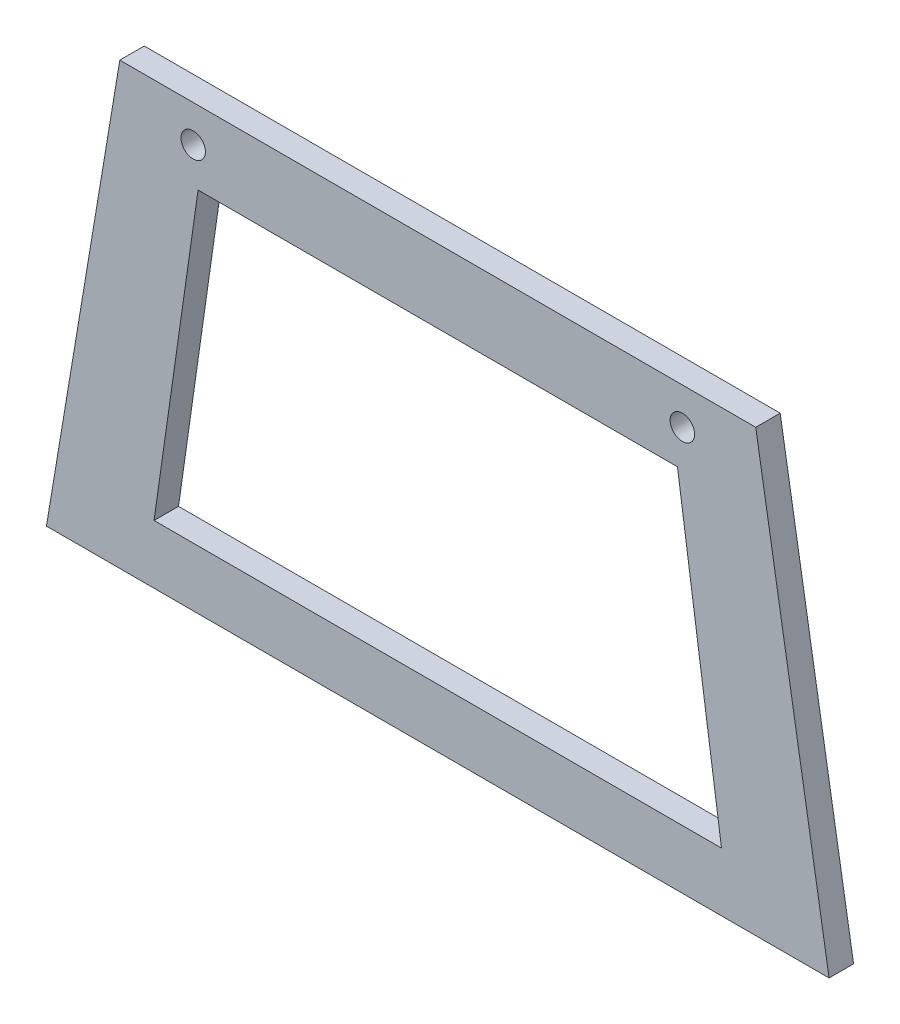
ISO-10303-21;
HEADER;
FILE_DESCRIPTION(('STEP AP214'),'2;1');
FILE_NAME('part.step','',(''),(''),'','','');
FILE_SCHEMA(('AUTOMOTIVE_DESIGN { 1 0 10303 214 1 1 1 1 }'));
ENDSEC;
DATA;
#1=APPLICATION_CONTEXT('core data for automotive mechanical design processes');
#2=APPLICATION_PROTOCOL_DEFINITION('international standard','automotive_design',2000,#1);
#3=PRODUCT_CONTEXT('',#1,'mechanical');
#4=PRODUCT('Part','Part','',(#3));
#5=PRODUCT_RELATED_PRODUCT_CATEGORY('part','',(#4));
#6=PRODUCT_DEFINITION_FORMATION('','',#4);
#7=PRODUCT_DEFINITION_CONTEXT('part definition',#1,'design');
#8=PRODUCT_DEFINITION('design','',#6,#7);
#9=PRODUCT_DEFINITION_SHAPE('','',#8);
#10=(LENGTH_UNIT() NAMED_UNIT(*) SI_UNIT(.MILLI.,.METRE.));
#11=(NAMED_UNIT(*) PLANE_ANGLE_UNIT() SI_UNIT($,.RADIAN.));
#12=(NAMED_UNIT(*) SI_UNIT($,.STERADIAN.) SOLID_ANGLE_UNIT());
#13=UNCERTAINTY_MEASURE_WITH_UNIT(LENGTH_MEASURE(1.E-05),#10,'distance_accuracy_value','');
#14=(GEOMETRIC_REPRESENTATION_CONTEXT(3) GLOBAL_UNCERTAINTY_ASSIGNED_CONTEXT((#13)) GLOBAL_UNIT_ASSIGNED_CONTEXT((#10,
#11,#12)) REPRESENTATION_CONTEXT('',''));
#15=CARTESIAN_POINT('',(0.,0.,0.));
#16=DIRECTION('',(0.,0.,1.));
#17=DIRECTION('',(1.,0.,0.));
#18=AXIS2_PLACEMENT_3D('',#15,#16,#17);
#19=CARTESIAN_POINT('',(-82.55,114.3,3.175));
#20=DIRECTION('',(0.986393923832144,-0.164398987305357,0.));
#21=DIRECTION('',(0.164398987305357,0.986393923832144,0.));
#22=AXIS2_PLACEMENT_3D('',#19,#20,#21);
#23=PLANE('',#22);
#24=DIRECTION('',(-0.164398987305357,-0.986393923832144,0.));
#25=VECTOR('',#24,1.);
#26=CARTESIAN_POINT('',(-82.55,114.3,-3.175));
#27=LINE('',#26,#25);
#28=CARTESIAN_POINT('',(-82.55,114.3,-3.175));
#29=VERTEX_POINT('',#28);
#30=CARTESIAN_POINT('',(-101.6,0.,-3.175));
#31=VERTEX_POINT('',#30);
#32=EDGE_CURVE('E153',#29,#31,#27,.T.);
#33=ORIENTED_EDGE('',*,*,#32,.T.);
#34=DIRECTION('',(0.,0.,-1.));
#35=VECTOR('',#34,1.);
#36=CARTESIAN_POINT('',(-101.6,0.,3.175));
#37=LINE('',#36,#35);
#38=CARTESIAN_POINT('',(-101.6,0.,3.175));
#39=VERTEX_POINT('',#38);
#40=EDGE_CURVE('E110',#39,#31,#37,.T.);
#41=ORIENTED_EDGE('',*,*,#40,.F.);
#42=DIRECTION('',(-0.164398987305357,-0.986393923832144,0.));
#43=VECTOR('',#42,1.);
#44=CARTESIAN_POINT('',(-82.55,114.3,3.175));
#45=LINE('',#44,#43);
#46=CARTESIAN_POINT('',(-82.55,114.3,3.175));
#47=VERTEX_POINT('',#46);
#48=EDGE_CURVE('E146',#47,#39,#45,.T.);
#49=ORIENTED_EDGE('',*,*,#48,.F.);
#50=DIRECTION('',(0.,0.,-1.));
#51=VECTOR('',#50,1.);
#52=CARTESIAN_POINT('',(-82.55,114.3,3.175));
#53=LINE('',#52,#51);
#54=EDGE_CURVE('E142',#47,#29,#53,.T.);
#55=ORIENTED_EDGE('',*,*,#54,.T.);
#56=EDGE_LOOP('',(#33,#41,#49,#55));
#57=FACE_BOUND('',#56,.T.);
#58=ADVANCED_FACE('F41',(#57),#23,.F.);
#59=CARTESIAN_POINT('',(-101.6,0.,3.175));
#60=DIRECTION('',(0.,1.,0.));
#61=DIRECTION('',(0.,0.,1.));
#62=AXIS2_PLACEMENT_3D('',#59,#60,#61);
#63=PLANE('',#62);
#64=DIRECTION('',(1.,0.,0.));
#65=VECTOR('',#64,1.);
#66=CARTESIAN_POINT('',(-101.6,0.,-3.175));
#67=LINE('',#66,#65);
#68=CARTESIAN_POINT('',(101.6,0.,-3.175));
#69=VERTEX_POINT('',#68);
#70=EDGE_CURVE('E151',#31,#69,#67,.T.);
#71=ORIENTED_EDGE('',*,*,#70,.T.);
#72=DIRECTION('',(0.,0.,-1.));
#73=VECTOR('',#72,1.);
#74=CARTESIAN_POINT('',(101.6,0.,3.175));
#75=LINE('',#74,#73);
#76=CARTESIAN_POINT('',(101.6,0.,3.175));
#77=VERTEX_POINT('',#76);
#78=EDGE_CURVE('E136',#77,#69,#75,.T.);
#79=ORIENTED_EDGE('',*,*,#78,.F.);
#80=DIRECTION('',(1.,0.,0.));
#81=VECTOR('',#80,1.);
#82=CARTESIAN_POINT('',(-101.6,0.,3.175));
#83=LINE('',#82,#81);
#84=EDGE_CURVE('E157',#39,#77,#83,.T.);
#85=ORIENTED_EDGE('',*,*,#84,.F.);
#86=ORIENTED_EDGE('',*,*,#40,.T.);
#87=EDGE_LOOP('',(#71,#79,#85,#86));
#88=FACE_BOUND('',#87,.T.);
#89=ADVANCED_FACE('F195',(#88),#63,.F.);
#90=CARTESIAN_POINT('',(101.6,0.,3.175));
#91=DIRECTION('',(-0.986393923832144,-0.164398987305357,0.));
#92=DIRECTION('',(0.164398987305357,-0.986393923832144,0.));
#93=AXIS2_PLACEMENT_3D('',#90,#91,#92);
#94=PLANE('',#93);
#95=DIRECTION('',(-0.164398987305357,0.986393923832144,0.));
#96=VECTOR('',#95,1.);
#97=CARTESIAN_POINT('',(101.6,0.,-3.175));
#98=LINE('',#97,#96);
#99=CARTESIAN_POINT('',(82.55,114.3,-3.175));
#100=VERTEX_POINT('',#99);
#101=EDGE_CURVE('E149',#69,#100,#98,.T.);
#102=ORIENTED_EDGE('',*,*,#101,.T.);
#103=DIRECTION('',(0.,0.,-1.));
#104=VECTOR('',#103,1.);
#105=CARTESIAN_POINT('',(82.55,114.3,3.175));
#106=LINE('',#105,#104);
#107=CARTESIAN_POINT('',(82.55,114.3,3.175));
#108=VERTEX_POINT('',#107);
#109=EDGE_CURVE('E138',#108,#100,#106,.T.);
#110=ORIENTED_EDGE('',*,*,#109,.F.);
#111=DIRECTION('',(-0.164398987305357,0.986393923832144,0.));
#112=VECTOR('',#111,1.);
#113=CARTESIAN_POINT('',(101.6,0.,3.175));
#114=LINE('',#113,#112);
#115=EDGE_CURVE('E160',#77,#108,#114,.T.);
#116=ORIENTED_EDGE('',*,*,#115,.F.);
#117=ORIENTED_EDGE('',*,*,#78,.T.);
#118=EDGE_LOOP('',(#102,#110,#116,#117));
#119=FACE_BOUND('',#118,.T.);
#120=ADVANCED_FACE('F199',(#119),#94,.F.);
#121=CARTESIAN_POINT('',(82.55,114.3,3.175));
#122=DIRECTION('',(0.,-1.,0.));
#123=DIRECTION('',(0.,0.,-1.));
#124=AXIS2_PLACEMENT_3D('',#121,#122,#123);
#125=PLANE('',#124);
#126=DIRECTION('',(-1.,0.,0.));
#127=VECTOR('',#126,1.);
#128=CARTESIAN_POINT('',(82.55,114.3,-3.175));
#129=LINE('',#128,#127);
#130=EDGE_CURVE('E148',#100,#29,#129,.T.);
#131=ORIENTED_EDGE('',*,*,#130,.T.);
#132=ORIENTED_EDGE('',*,*,#54,.F.);
#133=DIRECTION('',(-1.,0.,0.));
#134=VECTOR('',#133,1.);
#135=CARTESIAN_POINT('',(82.55,114.3,3.175));
#136=LINE('',#135,#134);
#137=EDGE_CURVE('E144',#108,#47,#136,.T.);
#138=ORIENTED_EDGE('',*,*,#137,.F.);
#139=ORIENTED_EDGE('',*,*,#109,.T.);
#140=EDGE_LOOP('',(#131,#132,#138,#139));
#141=FACE_BOUND('',#140,.T.);
#142=ADVANCED_FACE('F214',(#141),#125,.F.);
#143=CARTESIAN_POINT('',(0.,0.,3.175));
#144=DIRECTION('',(0.,0.,1.));
#145=DIRECTION('',(1.,0.,0.));
#146=AXIS2_PLACEMENT_3D('',#143,#144,#145);
#147=PLANE('',#146);
#148=DIRECTION('',(-0.141421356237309,-0.989949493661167,0.));
#149=VECTOR('',#148,1.);
#150=CARTESIAN_POINT('',(-74.3204,10.6172,3.175));
#151=LINE('',#150,#149);
#152=CARTESIAN_POINT('',(-62.23,95.25,3.175));
#153=VERTEX_POINT('',#152);
#154=CARTESIAN_POINT('',(-73.66,15.24,3.175));
#155=VERTEX_POINT('',#154);
#156=EDGE_CURVE('E111',#153,#155,#151,.T.);
#157=ORIENTED_EDGE('',*,*,#156,.F.);
#158=DIRECTION('',(-1.,0.,0.));
#159=VECTOR('',#158,1.);
#160=CARTESIAN_POINT('',(0.,95.25,3.175));
#161=LINE('',#160,#159);
#162=CARTESIAN_POINT('',(62.23,95.25,3.175));
#163=VERTEX_POINT('',#162);
#164=EDGE_CURVE('E163',#163,#153,#161,.T.);
#165=ORIENTED_EDGE('',*,*,#164,.F.);
#166=DIRECTION('',(-0.141421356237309,0.989949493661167,0.));
#167=VECTOR('',#166,1.);
#168=CARTESIAN_POINT('',(74.3204,10.6172,3.175));
#169=LINE('',#168,#167);
#170=CARTESIAN_POINT('',(73.66,15.24,3.175));
#171=VERTEX_POINT('',#170);
#172=EDGE_CURVE('E167',#171,#163,#169,.T.);
#173=ORIENTED_EDGE('',*,*,#172,.F.);
#174=DIRECTION('',(1.,0.,0.));
#175=VECTOR('',#174,1.);
#176=CARTESIAN_POINT('',(0.,15.24,3.175));
#177=LINE('',#176,#175);
#178=EDGE_CURVE('E169',#155,#171,#177,.T.);
#179=ORIENTED_EDGE('',*,*,#178,.F.);
#180=EDGE_LOOP('',(#157,#165,#173,#179));
#181=FACE_BOUND('',#180,.T.);
#182=CARTESIAN_POINT('',(-63.5,104.775,3.175));
#183=DIRECTION('',(0.,0.,1.));
#184=DIRECTION('',(1.,0.,0.));
#185=AXIS2_PLACEMENT_3D('',#182,#183,#184);
#186=CIRCLE('',#185,3.175);
#187=CARTESIAN_POINT('',(-60.325,104.775,3.175));
#188=VERTEX_POINT('',#187);
#189=EDGE_CURVE('E126',#188,#188,#186,.T.);
#190=ORIENTED_EDGE('',*,*,#189,.F.);
#191=EDGE_LOOP('',(#190));
#192=FACE_BOUND('',#191,.T.);
#193=CARTESIAN_POINT('',(63.5,104.775,3.175));
#194=DIRECTION('',(0.,0.,1.));
#195=DIRECTION('',(1.,0.,0.));
#196=AXIS2_PLACEMENT_3D('',#193,#194,#195);
#197=CIRCLE('',#196,3.175);
#198=CARTESIAN_POINT('',(66.675,104.775,3.175));
#199=VERTEX_POINT('',#198);
#200=EDGE_CURVE('E129',#199,#199,#197,.T.);
#201=ORIENTED_EDGE('',*,*,#200,.F.);
#202=EDGE_LOOP('',(#201));
#203=FACE_BOUND('',#202,.T.);
#204=ORIENTED_EDGE('',*,*,#48,.T.);
#205=ORIENTED_EDGE('',*,*,#84,.T.);
#206=ORIENTED_EDGE('',*,*,#115,.T.);
#207=ORIENTED_EDGE('',*,*,#137,.T.);
#208=EDGE_LOOP('',(#204,#205,#206,#207));
#209=FACE_BOUND('',#208,.T.);
#210=ADVANCED_FACE('F178',(#181,#192,#203,#209),#147,.T.);
#211=CARTESIAN_POINT('',(0.,0.,-3.175));
#212=DIRECTION('',(0.,0.,1.));
#213=DIRECTION('',(1.,0.,0.));
#214=AXIS2_PLACEMENT_3D('',#211,#212,#213);
#215=PLANE('',#214);
#216=DIRECTION('',(-1.,0.,0.));
#217=VECTOR('',#216,1.);
#218=CARTESIAN_POINT('',(0.,95.25,-3.175));
#219=LINE('',#218,#217);
#220=CARTESIAN_POINT('',(62.23,95.25,-3.175));
#221=VERTEX_POINT('',#220);
#222=CARTESIAN_POINT('',(-62.23,95.25,-3.175));
#223=VERTEX_POINT('',#222);
#224=EDGE_CURVE('E48',#221,#223,#219,.T.);
#225=ORIENTED_EDGE('',*,*,#224,.T.);
#226=DIRECTION('',(-0.141421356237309,-0.989949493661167,0.));
#227=VECTOR('',#226,1.);
#228=CARTESIAN_POINT('',(-74.3204,10.6172,-3.175));
#229=LINE('',#228,#227);
#230=CARTESIAN_POINT('',(-73.66,15.24,-3.175));
#231=VERTEX_POINT('',#230);
#232=EDGE_CURVE('E11',#223,#231,#229,.T.);
#233=ORIENTED_EDGE('',*,*,#232,.T.);
#234=DIRECTION('',(1.,0.,0.));
#235=VECTOR('',#234,1.);
#236=CARTESIAN_POINT('',(0.,15.24,-3.175));
#237=LINE('',#236,#235);
#238=CARTESIAN_POINT('',(73.66,15.24,-3.175));
#239=VERTEX_POINT('',#238);
#240=EDGE_CURVE('E105',#231,#239,#237,.T.);
#241=ORIENTED_EDGE('',*,*,#240,.T.);
#242=DIRECTION('',(-0.141421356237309,0.989949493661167,0.));
#243=VECTOR('',#242,1.);
#244=CARTESIAN_POINT('',(74.3204,10.6172,-3.175));
#245=LINE('',#244,#243);
#246=EDGE_CURVE('E106',#239,#221,#245,.T.);
#247=ORIENTED_EDGE('',*,*,#246,.T.);
#248=EDGE_LOOP('',(#225,#233,#241,#247));
#249=FACE_BOUND('',#248,.T.);
#250=CARTESIAN_POINT('',(-63.5,104.775,-3.175));
#251=DIRECTION('',(0.,0.,1.));
#252=DIRECTION('',(1.,0.,0.));
#253=AXIS2_PLACEMENT_3D('',#250,#251,#252);
#254=CIRCLE('',#253,3.175);
#255=CARTESIAN_POINT('',(-60.325,104.775,-3.175));
#256=VERTEX_POINT('',#255);
#257=EDGE_CURVE('E125',#256,#256,#254,.T.);
#258=ORIENTED_EDGE('',*,*,#257,.T.);
#259=EDGE_LOOP('',(#258));
#260=FACE_BOUND('',#259,.T.);
#261=CARTESIAN_POINT('',(63.5,104.775,-3.175));
#262=DIRECTION('',(0.,0.,1.));
#263=DIRECTION('',(1.,0.,0.));
#264=AXIS2_PLACEMENT_3D('',#261,#262,#263);
#265=CIRCLE('',#264,3.175);
#266=CARTESIAN_POINT('',(66.675,104.775,-3.175));
#267=VERTEX_POINT('',#266);
#268=EDGE_CURVE('E128',#267,#267,#265,.T.);
#269=ORIENTED_EDGE('',*,*,#268,.T.);
#270=EDGE_LOOP('',(#269));
#271=FACE_BOUND('',#270,.T.);
#272=ORIENTED_EDGE('',*,*,#32,.F.);
#273=ORIENTED_EDGE('',*,*,#130,.F.);
#274=ORIENTED_EDGE('',*,*,#101,.F.);
#275=ORIENTED_EDGE('',*,*,#70,.F.);
#276=EDGE_LOOP('',(#272,#273,#274,#275));
#277=FACE_BOUND('',#276,.T.);
#278=ADVANCED_FACE('F119',(#249,#260,#271,#277),#215,.F.);
#279=CARTESIAN_POINT('',(63.5,104.775,-12.7));
#280=DIRECTION('',(0.,0.,1.));
#281=DIRECTION('',(1.,0.,0.));
#282=AXIS2_PLACEMENT_3D('',#279,#280,#281);
#283=CYLINDRICAL_SURFACE('',#282,3.175);
#284=ORIENTED_EDGE('',*,*,#200,.T.);
#285=EDGE_LOOP('',(#284));
#286=FACE_BOUND('',#285,.T.);
#287=ORIENTED_EDGE('',*,*,#268,.F.);
#288=EDGE_LOOP('',(#287));
#289=FACE_BOUND('',#288,.T.);
#290=ADVANCED_FACE('F227',(#286,#289),#283,.F.);
#291=CARTESIAN_POINT('',(-63.5,104.775,-12.7));
#292=DIRECTION('',(0.,0.,1.));
#293=DIRECTION('',(1.,0.,0.));
#294=AXIS2_PLACEMENT_3D('',#291,#292,#293);
#295=CYLINDRICAL_SURFACE('',#294,3.175);
#296=ORIENTED_EDGE('',*,*,#189,.T.);
#297=EDGE_LOOP('',(#296));
#298=FACE_BOUND('',#297,.T.);
#299=ORIENTED_EDGE('',*,*,#257,.F.);
#300=EDGE_LOOP('',(#299));
#301=FACE_BOUND('',#300,.T.);
#302=ADVANCED_FACE('F192',(#298,#301),#295,.F.);
#303=CARTESIAN_POINT('',(-62.23,95.25,-12.7));
#304=DIRECTION('',(-0.989949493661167,0.141421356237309,0.));
#305=DIRECTION('',(-0.141421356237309,-0.989949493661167,0.));
#306=AXIS2_PLACEMENT_3D('',#303,#304,#305);
#307=PLANE('',#306);
#308=ORIENTED_EDGE('',*,*,#156,.T.);
#309=DIRECTION('',(0.,0.,1.));
#310=VECTOR('',#309,1.);
#311=CARTESIAN_POINT('',(-73.66,15.24,-12.7));
#312=LINE('',#311,#310);
#313=EDGE_CURVE('E54',#231,#155,#312,.T.);
#314=ORIENTED_EDGE('',*,*,#313,.F.);
#315=ORIENTED_EDGE('',*,*,#232,.F.);
#316=DIRECTION('',(0.,0.,1.));
#317=VECTOR('',#316,1.);
#318=CARTESIAN_POINT('',(-62.23,95.25,-12.7));
#319=LINE('',#318,#317);
#320=EDGE_CURVE('E134',#223,#153,#319,.T.);
#321=ORIENTED_EDGE('',*,*,#320,.T.);
#322=EDGE_LOOP('',(#308,#314,#315,#321));
#323=FACE_BOUND('',#322,.T.);
#324=ADVANCED_FACE('F109',(#323),#307,.F.);
#325=CARTESIAN_POINT('',(62.23,95.25,-12.7));
#326=DIRECTION('',(0.,1.,0.));
#327=DIRECTION('',(0.,0.,1.));
#328=AXIS2_PLACEMENT_3D('',#325,#326,#327);
#329=PLANE('',#328);
#330=ORIENTED_EDGE('',*,*,#164,.T.);
#331=ORIENTED_EDGE('',*,*,#320,.F.);
#332=ORIENTED_EDGE('',*,*,#224,.F.);
#333=DIRECTION('',(0.,0.,1.));
#334=VECTOR('',#333,1.);
#335=CARTESIAN_POINT('',(62.23,95.25,-12.7));
#336=LINE('',#335,#334);
#337=EDGE_CURVE('E173',#221,#163,#336,.T.);
#338=ORIENTED_EDGE('',*,*,#337,.T.);
#339=EDGE_LOOP('',(#330,#331,#332,#338));
#340=FACE_BOUND('',#339,.T.);
#341=ADVANCED_FACE('F184',(#340),#329,.F.);
#342=CARTESIAN_POINT('',(73.66,15.24,-12.7));
#343=DIRECTION('',(0.989949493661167,0.141421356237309,0.));
#344=DIRECTION('',(-0.141421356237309,0.989949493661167,0.));
#345=AXIS2_PLACEMENT_3D('',#342,#343,#344);
#346=PLANE('',#345);
#347=ORIENTED_EDGE('',*,*,#172,.T.);
#348=ORIENTED_EDGE('',*,*,#337,.F.);
#349=ORIENTED_EDGE('',*,*,#246,.F.);
#350=DIRECTION('',(0.,0.,1.));
#351=VECTOR('',#350,1.);
#352=CARTESIAN_POINT('',(73.66,15.24,-12.7));
#353=LINE('',#352,#351);
#354=EDGE_CURVE('E58',#239,#171,#353,.T.);
#355=ORIENTED_EDGE('',*,*,#354,.T.);
#356=EDGE_LOOP('',(#347,#348,#349,#355));
#357=FACE_BOUND('',#356,.T.);
#358=ADVANCED_FACE('F181',(#357),#346,.F.);
#359=CARTESIAN_POINT('',(-73.66,15.24,-12.7));
#360=DIRECTION('',(0.,-1.,0.));
#361=DIRECTION('',(0.,0.,-1.));
#362=AXIS2_PLACEMENT_3D('',#359,#360,#361);
#363=PLANE('',#362);
#364=ORIENTED_EDGE('',*,*,#178,.T.);
#365=ORIENTED_EDGE('',*,*,#354,.F.);
#366=ORIENTED_EDGE('',*,*,#240,.F.);
#367=ORIENTED_EDGE('',*,*,#313,.T.);
#368=EDGE_LOOP('',(#364,#365,#366,#367));
#369=FACE_BOUND('',#368,.T.);
#370=ADVANCED_FACE('F103',(#369),#363,.F.);
#371=CLOSED_SHELL('',(#58,#89,#120,#142,#210,#278,#290,#302,#324,#341,#358,#370));
#372=MANIFOLD_SOLID_BREP('B2',#371);
#373=ADVANCED_BREP_SHAPE_REPRESENTATION('',(#18,#372),#14);
#374=SHAPE_DEFINITION_REPRESENTATION(#9,#373);
ENDSEC;
END-ISO-10303-21;
